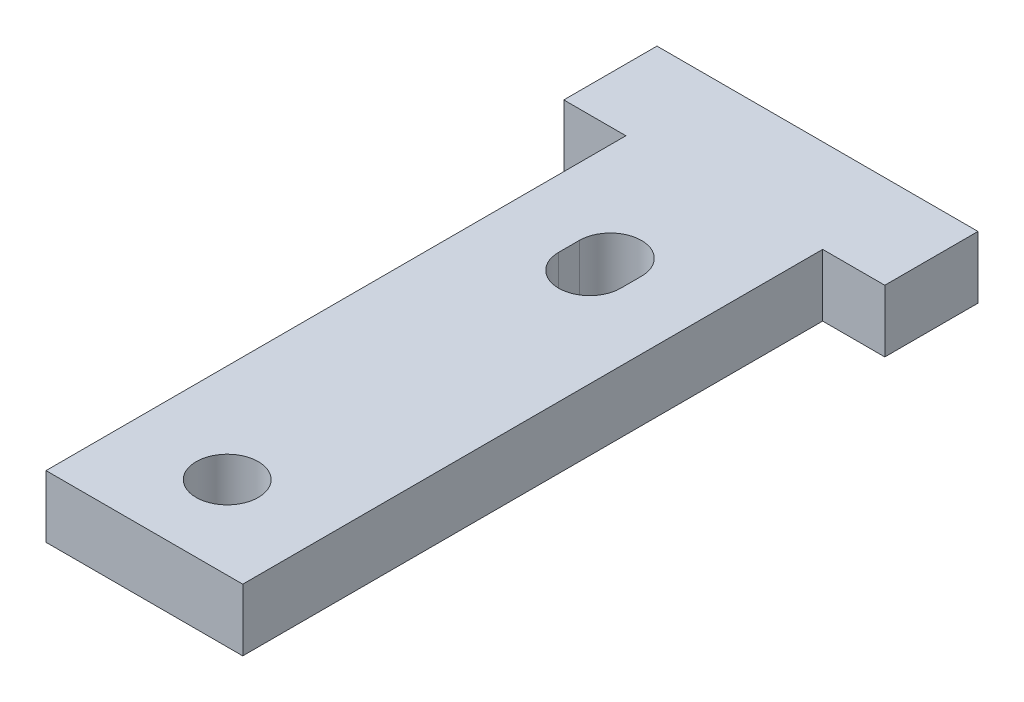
ISO-10303-21;
HEADER;
FILE_DESCRIPTION(('STEP AP214'),'2;1');
FILE_NAME('part.step','',(''),(''),'','','');
FILE_SCHEMA(('AUTOMOTIVE_DESIGN { 1 0 10303 214 1 1 1 1 }'));
ENDSEC;
DATA;
#1=APPLICATION_CONTEXT('core data for automotive mechanical design processes');
#2=APPLICATION_PROTOCOL_DEFINITION('international standard','automotive_design',2000,#1);
#3=PRODUCT_CONTEXT('',#1,'mechanical');
#4=PRODUCT('Part','Part','',(#3));
#5=PRODUCT_RELATED_PRODUCT_CATEGORY('part','',(#4));
#6=PRODUCT_DEFINITION_FORMATION('','',#4);
#7=PRODUCT_DEFINITION_CONTEXT('part definition',#1,'design');
#8=PRODUCT_DEFINITION('design','',#6,#7);
#9=PRODUCT_DEFINITION_SHAPE('','',#8);
#10=(LENGTH_UNIT() NAMED_UNIT(*) SI_UNIT(.MILLI.,.METRE.));
#11=(NAMED_UNIT(*) PLANE_ANGLE_UNIT() SI_UNIT($,.RADIAN.));
#12=(NAMED_UNIT(*) SI_UNIT($,.STERADIAN.) SOLID_ANGLE_UNIT());
#13=UNCERTAINTY_MEASURE_WITH_UNIT(LENGTH_MEASURE(1.E-05),#10,'distance_accuracy_value','');
#14=(GEOMETRIC_REPRESENTATION_CONTEXT(3) GLOBAL_UNCERTAINTY_ASSIGNED_CONTEXT((#13)) GLOBAL_UNIT_ASSIGNED_CONTEXT((#10,
#11,#12)) REPRESENTATION_CONTEXT('',''));
#15=CARTESIAN_POINT('',(0.,0.,0.));
#16=DIRECTION('',(0.,0.,1.));
#17=DIRECTION('',(1.,0.,0.));
#18=AXIS2_PLACEMENT_3D('',#15,#16,#17);
#19=CARTESIAN_POINT('',(0.,3.,0.));
#20=DIRECTION('',(0.,-1.,0.));
#21=DIRECTION('',(0.,0.,-1.));
#22=AXIS2_PLACEMENT_3D('',#19,#20,#21);
#23=PLANE('',#22);
#24=DIRECTION('',(0.,0.,-1.));
#25=VECTOR('',#24,1.);
#26=CARTESIAN_POINT('',(7.75,3.,0.706755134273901));
#27=LINE('',#26,#25);
#28=CARTESIAN_POINT('',(7.75,3.,5.2067551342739));
#29=VERTEX_POINT('',#28);
#30=CARTESIAN_POINT('',(7.75,3.,0.706755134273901));
#31=VERTEX_POINT('',#30);
#32=EDGE_CURVE('E165',#29,#31,#27,.T.);
#33=ORIENTED_EDGE('',*,*,#32,.T.);
#34=DIRECTION('',(-1.,0.,0.));
#35=VECTOR('',#34,1.);
#36=CARTESIAN_POINT('',(-7.75,3.,0.706755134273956));
#37=LINE('',#36,#35);
#38=CARTESIAN_POINT('',(-7.75,3.,0.706755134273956));
#39=VERTEX_POINT('',#38);
#40=EDGE_CURVE('E168',#31,#39,#37,.T.);
#41=ORIENTED_EDGE('',*,*,#40,.T.);
#42=DIRECTION('',(0.,0.,1.));
#43=VECTOR('',#42,1.);
#44=CARTESIAN_POINT('',(-7.75,3.,0.706755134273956));
#45=LINE('',#44,#43);
#46=CARTESIAN_POINT('',(-7.75,3.,5.20675513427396));
#47=VERTEX_POINT('',#46);
#48=EDGE_CURVE('E171',#39,#47,#45,.T.);
#49=ORIENTED_EDGE('',*,*,#48,.T.);
#50=DIRECTION('',(1.,0.,0.));
#51=VECTOR('',#50,1.);
#52=CARTESIAN_POINT('',(-7.75,3.,5.20675513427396));
#53=LINE('',#52,#51);
#54=CARTESIAN_POINT('',(-4.75,3.,5.20675513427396));
#55=VERTEX_POINT('',#54);
#56=EDGE_CURVE('E173',#47,#55,#53,.T.);
#57=ORIENTED_EDGE('',*,*,#56,.T.);
#58=DIRECTION('',(0.,0.,1.));
#59=VECTOR('',#58,1.);
#60=CARTESIAN_POINT('',(-4.75,3.,5.20675513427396));
#61=LINE('',#60,#59);
#62=CARTESIAN_POINT('',(-4.75,3.,33.2067551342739));
#63=VERTEX_POINT('',#62);
#64=EDGE_CURVE('E175',#55,#63,#61,.T.);
#65=ORIENTED_EDGE('',*,*,#64,.T.);
#66=DIRECTION('',(1.,0.,0.));
#67=VECTOR('',#66,1.);
#68=CARTESIAN_POINT('',(4.75,3.,33.2067551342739));
#69=LINE('',#68,#67);
#70=CARTESIAN_POINT('',(4.75,3.,33.2067551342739));
#71=VERTEX_POINT('',#70);
#72=EDGE_CURVE('E177',#63,#71,#69,.T.);
#73=ORIENTED_EDGE('',*,*,#72,.T.);
#74=DIRECTION('',(0.,0.,-1.));
#75=VECTOR('',#74,1.);
#76=CARTESIAN_POINT('',(4.75,3.,5.2067551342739));
#77=LINE('',#76,#75);
#78=CARTESIAN_POINT('',(4.75,3.,5.2067551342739));
#79=VERTEX_POINT('',#78);
#80=EDGE_CURVE('E179',#71,#79,#77,.T.);
#81=ORIENTED_EDGE('',*,*,#80,.T.);
#82=DIRECTION('',(1.,0.,0.));
#83=VECTOR('',#82,1.);
#84=CARTESIAN_POINT('',(7.75,3.,5.2067551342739));
#85=LINE('',#84,#83);
#86=EDGE_CURVE('E181',#79,#29,#85,.T.);
#87=ORIENTED_EDGE('',*,*,#86,.T.);
#88=EDGE_LOOP('',(#33,#41,#49,#57,#65,#73,#81,#87));
#89=FACE_BOUND('',#88,.T.);
#90=CARTESIAN_POINT('',(0.,3.,10.7067551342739));
#91=DIRECTION('',(0.,1.,0.));
#92=DIRECTION('',(0.,0.,1.));
#93=AXIS2_PLACEMENT_3D('',#90,#91,#92);
#94=CIRCLE('',#93,1.5);
#95=CARTESIAN_POINT('',(1.5,3.,10.7067551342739));
#96=VERTEX_POINT('',#95);
#97=CARTESIAN_POINT('',(-1.5,3.,10.7067551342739));
#98=VERTEX_POINT('',#97);
#99=EDGE_CURVE('E126',#96,#98,#94,.T.);
#100=ORIENTED_EDGE('',*,*,#99,.F.);
#101=DIRECTION('',(0.,0.,-1.));
#102=VECTOR('',#101,1.);
#103=CARTESIAN_POINT('',(1.5,3.,11.2648457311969));
#104=LINE('',#103,#102);
#105=CARTESIAN_POINT('',(1.5,3.,11.7067551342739));
#106=VERTEX_POINT('',#105);
#107=EDGE_CURVE('E149',#106,#96,#104,.T.);
#108=ORIENTED_EDGE('',*,*,#107,.F.);
#109=CARTESIAN_POINT('',(0.,3.,11.7067551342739));
#110=DIRECTION('',(0.,1.,0.));
#111=DIRECTION('',(0.,0.,1.));
#112=AXIS2_PLACEMENT_3D('',#109,#110,#111);
#113=CIRCLE('',#112,1.5);
#114=CARTESIAN_POINT('',(-1.5,3.,11.7067551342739));
#115=VERTEX_POINT('',#114);
#116=EDGE_CURVE('E147',#115,#106,#113,.T.);
#117=ORIENTED_EDGE('',*,*,#116,.F.);
#118=DIRECTION('',(0.,0.,1.));
#119=VECTOR('',#118,1.);
#120=CARTESIAN_POINT('',(-1.5,3.,11.2648457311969));
#121=LINE('',#120,#119);
#122=EDGE_CURVE('E134',#98,#115,#121,.T.);
#123=ORIENTED_EDGE('',*,*,#122,.F.);
#124=EDGE_LOOP('',(#100,#108,#117,#123));
#125=FACE_BOUND('',#124,.T.);
#126=CARTESIAN_POINT('',(0.,3.,29.2067551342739));
#127=DIRECTION('',(0.,1.,0.));
#128=DIRECTION('',(0.,0.,1.));
#129=AXIS2_PLACEMENT_3D('',#126,#127,#128);
#130=CIRCLE('',#129,1.5);
#131=CARTESIAN_POINT('',(0.,3.,30.7067551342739));
#132=VERTEX_POINT('',#131);
#133=EDGE_CURVE('E155',#132,#132,#130,.T.);
#134=ORIENTED_EDGE('',*,*,#133,.F.);
#135=EDGE_LOOP('',(#134));
#136=FACE_BOUND('',#135,.T.);
#137=ADVANCED_FACE('F37',(#89,#125,#136),#23,.F.);
#138=CARTESIAN_POINT('',(0.,0.,0.));
#139=DIRECTION('',(0.,-1.,0.));
#140=DIRECTION('',(0.,0.,-1.));
#141=AXIS2_PLACEMENT_3D('',#138,#139,#140);
#142=PLANE('',#141);
#143=DIRECTION('',(0.,0.,-1.));
#144=VECTOR('',#143,1.);
#145=CARTESIAN_POINT('',(1.5,0.,11.2648457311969));
#146=LINE('',#145,#144);
#147=CARTESIAN_POINT('',(1.5,0.,11.7067551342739));
#148=VERTEX_POINT('',#147);
#149=CARTESIAN_POINT('',(1.5,0.,10.7067551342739));
#150=VERTEX_POINT('',#149);
#151=EDGE_CURVE('E135',#148,#150,#146,.T.);
#152=ORIENTED_EDGE('',*,*,#151,.T.);
#153=CARTESIAN_POINT('',(0.,0.,10.7067551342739));
#154=DIRECTION('',(0.,1.,0.));
#155=DIRECTION('',(0.,0.,1.));
#156=AXIS2_PLACEMENT_3D('',#153,#154,#155);
#157=CIRCLE('',#156,1.5);
#158=CARTESIAN_POINT('',(-1.5,0.,10.7067551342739));
#159=VERTEX_POINT('',#158);
#160=EDGE_CURVE('E60',#150,#159,#157,.T.);
#161=ORIENTED_EDGE('',*,*,#160,.T.);
#162=DIRECTION('',(0.,0.,1.));
#163=VECTOR('',#162,1.);
#164=CARTESIAN_POINT('',(-1.5,0.,11.2648457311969));
#165=LINE('',#164,#163);
#166=CARTESIAN_POINT('',(-1.5,0.,11.7067551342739));
#167=VERTEX_POINT('',#166);
#168=EDGE_CURVE('E141',#159,#167,#165,.T.);
#169=ORIENTED_EDGE('',*,*,#168,.T.);
#170=CARTESIAN_POINT('',(0.,0.,11.7067551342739));
#171=DIRECTION('',(0.,1.,0.));
#172=DIRECTION('',(0.,0.,1.));
#173=AXIS2_PLACEMENT_3D('',#170,#171,#172);
#174=CIRCLE('',#173,1.5);
#175=EDGE_CURVE('E157',#167,#148,#174,.T.);
#176=ORIENTED_EDGE('',*,*,#175,.T.);
#177=EDGE_LOOP('',(#152,#161,#169,#176));
#178=FACE_BOUND('',#177,.T.);
#179=DIRECTION('',(0.,0.,-1.));
#180=VECTOR('',#179,1.);
#181=CARTESIAN_POINT('',(7.75,0.,0.706755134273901));
#182=LINE('',#181,#180);
#183=CARTESIAN_POINT('',(7.75,0.,5.2067551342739));
#184=VERTEX_POINT('',#183);
#185=CARTESIAN_POINT('',(7.75,0.,0.706755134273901));
#186=VERTEX_POINT('',#185);
#187=EDGE_CURVE('E142',#184,#186,#182,.T.);
#188=ORIENTED_EDGE('',*,*,#187,.F.);
#189=DIRECTION('',(1.,0.,0.));
#190=VECTOR('',#189,1.);
#191=CARTESIAN_POINT('',(7.75,0.,5.2067551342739));
#192=LINE('',#191,#190);
#193=CARTESIAN_POINT('',(4.75,0.,5.2067551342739));
#194=VERTEX_POINT('',#193);
#195=EDGE_CURVE('E169',#194,#184,#192,.T.);
#196=ORIENTED_EDGE('',*,*,#195,.F.);
#197=DIRECTION('',(0.,0.,-1.));
#198=VECTOR('',#197,1.);
#199=CARTESIAN_POINT('',(4.75,0.,5.2067551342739));
#200=LINE('',#199,#198);
#201=CARTESIAN_POINT('',(4.75,0.,33.2067551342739));
#202=VERTEX_POINT('',#201);
#203=EDGE_CURVE('E196',#202,#194,#200,.T.);
#204=ORIENTED_EDGE('',*,*,#203,.F.);
#205=DIRECTION('',(1.,0.,0.));
#206=VECTOR('',#205,1.);
#207=CARTESIAN_POINT('',(4.75,0.,33.2067551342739));
#208=LINE('',#207,#206);
#209=CARTESIAN_POINT('',(-4.75,0.,33.2067551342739));
#210=VERTEX_POINT('',#209);
#211=EDGE_CURVE('E194',#210,#202,#208,.T.);
#212=ORIENTED_EDGE('',*,*,#211,.F.);
#213=DIRECTION('',(0.,0.,1.));
#214=VECTOR('',#213,1.);
#215=CARTESIAN_POINT('',(-4.75,0.,5.20675513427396));
#216=LINE('',#215,#214);
#217=CARTESIAN_POINT('',(-4.75,0.,5.20675513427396));
#218=VERTEX_POINT('',#217);
#219=EDGE_CURVE('E192',#218,#210,#216,.T.);
#220=ORIENTED_EDGE('',*,*,#219,.F.);
#221=DIRECTION('',(1.,0.,0.));
#222=VECTOR('',#221,1.);
#223=CARTESIAN_POINT('',(-7.75,0.,5.20675513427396));
#224=LINE('',#223,#222);
#225=CARTESIAN_POINT('',(-7.75,0.,5.20675513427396));
#226=VERTEX_POINT('',#225);
#227=EDGE_CURVE('E190',#226,#218,#224,.T.);
#228=ORIENTED_EDGE('',*,*,#227,.F.);
#229=DIRECTION('',(0.,0.,1.));
#230=VECTOR('',#229,1.);
#231=CARTESIAN_POINT('',(-7.75,0.,0.706755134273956));
#232=LINE('',#231,#230);
#233=CARTESIAN_POINT('',(-7.75,0.,0.706755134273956));
#234=VERTEX_POINT('',#233);
#235=EDGE_CURVE('E188',#234,#226,#232,.T.);
#236=ORIENTED_EDGE('',*,*,#235,.F.);
#237=DIRECTION('',(-1.,0.,0.));
#238=VECTOR('',#237,1.);
#239=CARTESIAN_POINT('',(-7.75,0.,0.706755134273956));
#240=LINE('',#239,#238);
#241=EDGE_CURVE('E186',#186,#234,#240,.T.);
#242=ORIENTED_EDGE('',*,*,#241,.F.);
#243=EDGE_LOOP('',(#188,#196,#204,#212,#220,#228,#236,#242));
#244=FACE_BOUND('',#243,.T.);
#245=CARTESIAN_POINT('',(0.,0.,29.2067551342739));
#246=DIRECTION('',(0.,1.,0.));
#247=DIRECTION('',(0.,0.,1.));
#248=AXIS2_PLACEMENT_3D('',#245,#246,#247);
#249=CIRCLE('',#248,1.5);
#250=CARTESIAN_POINT('',(0.,0.,30.7067551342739));
#251=VERTEX_POINT('',#250);
#252=EDGE_CURVE('E302',#251,#251,#249,.T.);
#253=ORIENTED_EDGE('',*,*,#252,.T.);
#254=EDGE_LOOP('',(#253));
#255=FACE_BOUND('',#254,.T.);
#256=ADVANCED_FACE('F226',(#178,#244,#255),#142,.T.);
#257=CARTESIAN_POINT('',(7.75,3.,0.706755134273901));
#258=DIRECTION('',(-1.,0.,0.));
#259=DIRECTION('',(0.,0.,1.));
#260=AXIS2_PLACEMENT_3D('',#257,#258,#259);
#261=PLANE('',#260);
#262=ORIENTED_EDGE('',*,*,#187,.T.);
#263=DIRECTION('',(0.,-1.,0.));
#264=VECTOR('',#263,1.);
#265=CARTESIAN_POINT('',(7.75,3.,0.706755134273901));
#266=LINE('',#265,#264);
#267=EDGE_CURVE('E11',#31,#186,#266,.T.);
#268=ORIENTED_EDGE('',*,*,#267,.F.);
#269=ORIENTED_EDGE('',*,*,#32,.F.);
#270=DIRECTION('',(0.,-1.,0.));
#271=VECTOR('',#270,1.);
#272=CARTESIAN_POINT('',(7.75,3.,5.2067551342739));
#273=LINE('',#272,#271);
#274=EDGE_CURVE('E183',#29,#184,#273,.T.);
#275=ORIENTED_EDGE('',*,*,#274,.T.);
#276=EDGE_LOOP('',(#262,#268,#269,#275));
#277=FACE_BOUND('',#276,.T.);
#278=ADVANCED_FACE('F39',(#277),#261,.F.);
#279=CARTESIAN_POINT('',(-7.75,3.,0.706755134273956));
#280=DIRECTION('',(0.,0.,1.));
#281=DIRECTION('',(1.,0.,0.));
#282=AXIS2_PLACEMENT_3D('',#279,#280,#281);
#283=PLANE('',#282);
#284=ORIENTED_EDGE('',*,*,#241,.T.);
#285=DIRECTION('',(0.,-1.,0.));
#286=VECTOR('',#285,1.);
#287=CARTESIAN_POINT('',(-7.75,3.,0.706755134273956));
#288=LINE('',#287,#286);
#289=EDGE_CURVE('E45',#39,#234,#288,.T.);
#290=ORIENTED_EDGE('',*,*,#289,.F.);
#291=ORIENTED_EDGE('',*,*,#40,.F.);
#292=ORIENTED_EDGE('',*,*,#267,.T.);
#293=EDGE_LOOP('',(#284,#290,#291,#292));
#294=FACE_BOUND('',#293,.T.);
#295=ADVANCED_FACE('F243',(#294),#283,.F.);
#296=CARTESIAN_POINT('',(-7.75,3.,0.706755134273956));
#297=DIRECTION('',(1.,0.,0.));
#298=DIRECTION('',(0.,0.,-1.));
#299=AXIS2_PLACEMENT_3D('',#296,#297,#298);
#300=PLANE('',#299);
#301=ORIENTED_EDGE('',*,*,#235,.T.);
#302=DIRECTION('',(0.,-1.,0.));
#303=VECTOR('',#302,1.);
#304=CARTESIAN_POINT('',(-7.75,3.,5.20675513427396));
#305=LINE('',#304,#303);
#306=EDGE_CURVE('E213',#47,#226,#305,.T.);
#307=ORIENTED_EDGE('',*,*,#306,.F.);
#308=ORIENTED_EDGE('',*,*,#48,.F.);
#309=ORIENTED_EDGE('',*,*,#289,.T.);
#310=EDGE_LOOP('',(#301,#307,#308,#309));
#311=FACE_BOUND('',#310,.T.);
#312=ADVANCED_FACE('F220',(#311),#300,.F.);
#313=CARTESIAN_POINT('',(-7.75,3.,5.20675513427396));
#314=DIRECTION('',(0.,0.,-1.));
#315=DIRECTION('',(-1.,0.,0.));
#316=AXIS2_PLACEMENT_3D('',#313,#314,#315);
#317=PLANE('',#316);
#318=ORIENTED_EDGE('',*,*,#227,.T.);
#319=DIRECTION('',(0.,-1.,0.));
#320=VECTOR('',#319,1.);
#321=CARTESIAN_POINT('',(-4.75,3.,5.20675513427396));
#322=LINE('',#321,#320);
#323=EDGE_CURVE('E210',#55,#218,#322,.T.);
#324=ORIENTED_EDGE('',*,*,#323,.F.);
#325=ORIENTED_EDGE('',*,*,#56,.F.);
#326=ORIENTED_EDGE('',*,*,#306,.T.);
#327=EDGE_LOOP('',(#318,#324,#325,#326));
#328=FACE_BOUND('',#327,.T.);
#329=ADVANCED_FACE('F232',(#328),#317,.F.);
#330=CARTESIAN_POINT('',(-4.75,3.,5.20675513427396));
#331=DIRECTION('',(1.,0.,0.));
#332=DIRECTION('',(0.,0.,-1.));
#333=AXIS2_PLACEMENT_3D('',#330,#331,#332);
#334=PLANE('',#333);
#335=ORIENTED_EDGE('',*,*,#219,.T.);
#336=DIRECTION('',(0.,-1.,0.));
#337=VECTOR('',#336,1.);
#338=CARTESIAN_POINT('',(-4.75,3.,33.2067551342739));
#339=LINE('',#338,#337);
#340=EDGE_CURVE('E207',#63,#210,#339,.T.);
#341=ORIENTED_EDGE('',*,*,#340,.F.);
#342=ORIENTED_EDGE('',*,*,#64,.F.);
#343=ORIENTED_EDGE('',*,*,#323,.T.);
#344=EDGE_LOOP('',(#335,#341,#342,#343));
#345=FACE_BOUND('',#344,.T.);
#346=ADVANCED_FACE('F236',(#345),#334,.F.);
#347=CARTESIAN_POINT('',(4.75,3.,33.2067551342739));
#348=DIRECTION('',(0.,0.,-1.));
#349=DIRECTION('',(-1.,0.,0.));
#350=AXIS2_PLACEMENT_3D('',#347,#348,#349);
#351=PLANE('',#350);
#352=ORIENTED_EDGE('',*,*,#211,.T.);
#353=DIRECTION('',(0.,-1.,0.));
#354=VECTOR('',#353,1.);
#355=CARTESIAN_POINT('',(4.75,3.,33.2067551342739));
#356=LINE('',#355,#354);
#357=EDGE_CURVE('E204',#71,#202,#356,.T.);
#358=ORIENTED_EDGE('',*,*,#357,.F.);
#359=ORIENTED_EDGE('',*,*,#72,.F.);
#360=ORIENTED_EDGE('',*,*,#340,.T.);
#361=EDGE_LOOP('',(#352,#358,#359,#360));
#362=FACE_BOUND('',#361,.T.);
#363=ADVANCED_FACE('F256',(#362),#351,.F.);
#364=CARTESIAN_POINT('',(4.75,3.,5.2067551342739));
#365=DIRECTION('',(-1.,0.,0.));
#366=DIRECTION('',(0.,0.,1.));
#367=AXIS2_PLACEMENT_3D('',#364,#365,#366);
#368=PLANE('',#367);
#369=ORIENTED_EDGE('',*,*,#203,.T.);
#370=DIRECTION('',(0.,-1.,0.));
#371=VECTOR('',#370,1.);
#372=CARTESIAN_POINT('',(4.75,3.,5.2067551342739));
#373=LINE('',#372,#371);
#374=EDGE_CURVE('E201',#79,#194,#373,.T.);
#375=ORIENTED_EDGE('',*,*,#374,.F.);
#376=ORIENTED_EDGE('',*,*,#80,.F.);
#377=ORIENTED_EDGE('',*,*,#357,.T.);
#378=EDGE_LOOP('',(#369,#375,#376,#377));
#379=FACE_BOUND('',#378,.T.);
#380=ADVANCED_FACE('F254',(#379),#368,.F.);
#381=CARTESIAN_POINT('',(7.75,3.,5.2067551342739));
#382=DIRECTION('',(0.,0.,-1.));
#383=DIRECTION('',(-1.,0.,0.));
#384=AXIS2_PLACEMENT_3D('',#381,#382,#383);
#385=PLANE('',#384);
#386=ORIENTED_EDGE('',*,*,#195,.T.);
#387=ORIENTED_EDGE('',*,*,#274,.F.);
#388=ORIENTED_EDGE('',*,*,#86,.F.);
#389=ORIENTED_EDGE('',*,*,#374,.T.);
#390=EDGE_LOOP('',(#386,#387,#388,#389));
#391=FACE_BOUND('',#390,.T.);
#392=ADVANCED_FACE('F249',(#391),#385,.F.);
#393=CARTESIAN_POINT('',(0.,3.,10.7067551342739));
#394=DIRECTION('',(0.,-1.,0.));
#395=DIRECTION('',(0.,0.,-1.));
#396=AXIS2_PLACEMENT_3D('',#393,#394,#395);
#397=CYLINDRICAL_SURFACE('',#396,1.5);
#398=ORIENTED_EDGE('',*,*,#160,.F.);
#399=DIRECTION('',(0.,-1.,0.));
#400=VECTOR('',#399,1.);
#401=CARTESIAN_POINT('',(1.5,3.,10.7067551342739));
#402=LINE('',#401,#400);
#403=EDGE_CURVE('E130',#96,#150,#402,.T.);
#404=ORIENTED_EDGE('',*,*,#403,.F.);
#405=ORIENTED_EDGE('',*,*,#99,.T.);
#406=DIRECTION('',(0.,-1.,0.));
#407=VECTOR('',#406,1.);
#408=CARTESIAN_POINT('',(-1.5,3.,10.7067551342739));
#409=LINE('',#408,#407);
#410=EDGE_CURVE('E129',#98,#159,#409,.T.);
#411=ORIENTED_EDGE('',*,*,#410,.T.);
#412=EDGE_LOOP('',(#398,#404,#405,#411));
#413=FACE_BOUND('',#412,.T.);
#414=ADVANCED_FACE('F128',(#413),#397,.F.);
#415=CARTESIAN_POINT('',(-1.5,3.,11.2648457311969));
#416=DIRECTION('',(1.,0.,0.));
#417=DIRECTION('',(0.,0.,-1.));
#418=AXIS2_PLACEMENT_3D('',#415,#416,#417);
#419=PLANE('',#418);
#420=ORIENTED_EDGE('',*,*,#168,.F.);
#421=ORIENTED_EDGE('',*,*,#410,.F.);
#422=ORIENTED_EDGE('',*,*,#122,.T.);
#423=DIRECTION('',(0.,-1.,0.));
#424=VECTOR('',#423,1.);
#425=CARTESIAN_POINT('',(-1.5,3.,11.7067551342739));
#426=LINE('',#425,#424);
#427=EDGE_CURVE('E143',#115,#167,#426,.T.);
#428=ORIENTED_EDGE('',*,*,#427,.T.);
#429=EDGE_LOOP('',(#420,#421,#422,#428));
#430=FACE_BOUND('',#429,.T.);
#431=ADVANCED_FACE('F138',(#430),#419,.T.);
#432=CARTESIAN_POINT('',(0.,3.,11.7067551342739));
#433=DIRECTION('',(0.,-1.,0.));
#434=DIRECTION('',(0.,0.,-1.));
#435=AXIS2_PLACEMENT_3D('',#432,#433,#434);
#436=CYLINDRICAL_SURFACE('',#435,1.5);
#437=ORIENTED_EDGE('',*,*,#175,.F.);
#438=ORIENTED_EDGE('',*,*,#427,.F.);
#439=ORIENTED_EDGE('',*,*,#116,.T.);
#440=DIRECTION('',(0.,-1.,0.));
#441=VECTOR('',#440,1.);
#442=CARTESIAN_POINT('',(1.5,3.,11.7067551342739));
#443=LINE('',#442,#441);
#444=EDGE_CURVE('E52',#106,#148,#443,.T.);
#445=ORIENTED_EDGE('',*,*,#444,.T.);
#446=EDGE_LOOP('',(#437,#438,#439,#445));
#447=FACE_BOUND('',#446,.T.);
#448=ADVANCED_FACE('F282',(#447),#436,.F.);
#449=CARTESIAN_POINT('',(1.5,3.,11.2648457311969));
#450=DIRECTION('',(-1.,0.,0.));
#451=DIRECTION('',(0.,0.,1.));
#452=AXIS2_PLACEMENT_3D('',#449,#450,#451);
#453=PLANE('',#452);
#454=ORIENTED_EDGE('',*,*,#151,.F.);
#455=ORIENTED_EDGE('',*,*,#444,.F.);
#456=ORIENTED_EDGE('',*,*,#107,.T.);
#457=ORIENTED_EDGE('',*,*,#403,.T.);
#458=EDGE_LOOP('',(#454,#455,#456,#457));
#459=FACE_BOUND('',#458,.T.);
#460=ADVANCED_FACE('F286',(#459),#453,.T.);
#461=CARTESIAN_POINT('',(0.,3.,29.2067551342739));
#462=DIRECTION('',(0.,-1.,0.));
#463=DIRECTION('',(0.,0.,-1.));
#464=AXIS2_PLACEMENT_3D('',#461,#462,#463);
#465=CYLINDRICAL_SURFACE('',#464,1.5);
#466=ORIENTED_EDGE('',*,*,#133,.T.);
#467=EDGE_LOOP('',(#466));
#468=FACE_BOUND('',#467,.T.);
#469=ORIENTED_EDGE('',*,*,#252,.F.);
#470=EDGE_LOOP('',(#469));
#471=FACE_BOUND('',#470,.T.);
#472=ADVANCED_FACE('F292',(#468,#471),#465,.F.);
#473=CLOSED_SHELL('',(#137,#256,#278,#295,#312,#329,#346,#363,#380,#392,#414,#431,#448,#460,#472));
#474=MANIFOLD_SOLID_BREP('B2',#473);
#475=ADVANCED_BREP_SHAPE_REPRESENTATION('',(#18,#474),#14);
#476=SHAPE_DEFINITION_REPRESENTATION(#9,#475);
ENDSEC;
END-ISO-10303-21;
